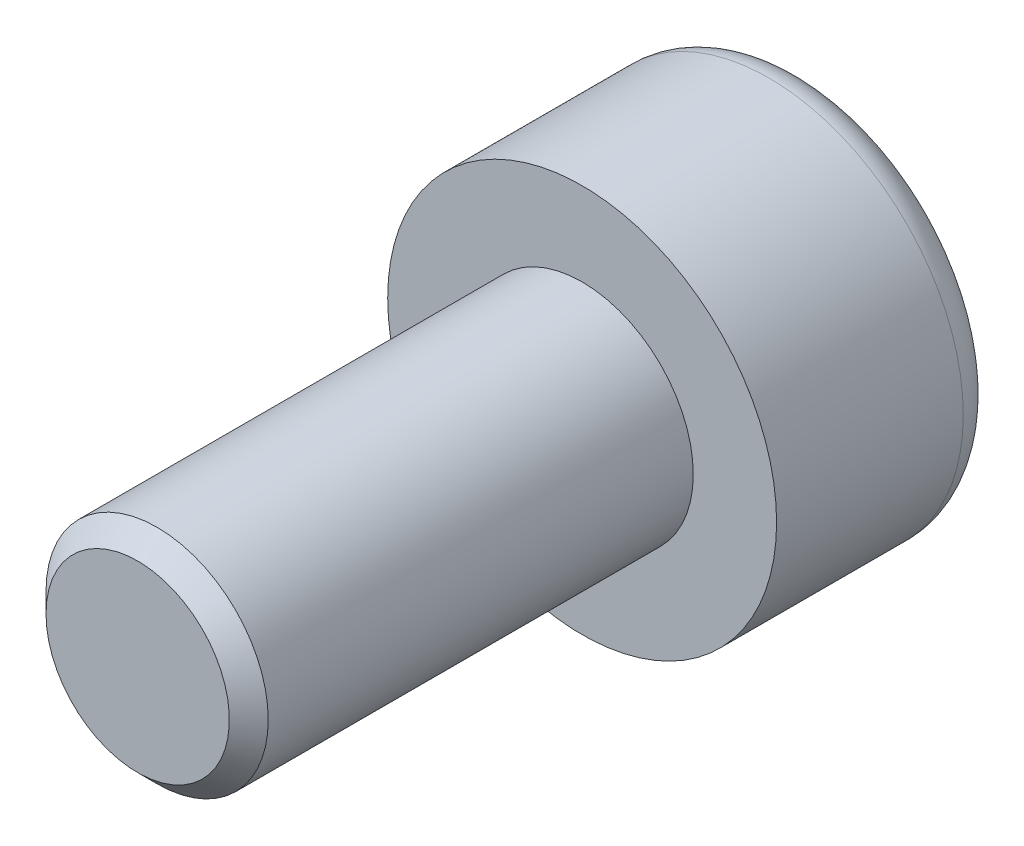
from build123d import *

# Parameters (mm, degrees)
ENLEV_MAT_EXTRU1_DEPTH = 2
ESQUISSE3_W            = 2
ESQUISSE3_H            = 8
CHANFREIN1_SIZE        = 0.35


with BuildPart() as part:
    # Esquisse1 → Base-R_volution (revolve)
    with BuildSketch(Plane(origin=(0, 0, 0), x_dir=(1, 0, 0), z_dir=(0, 1, 0)), mode=Mode.PRIVATE) as base_r_volution_sk:
        with BuildLine():
            Line((0, 0), (3.5, 0))
            Line((3.5, 0), (3.5, 3.36))
            ThreePointArc((3.5, 3.36), (3.31254834, 3.81254834), (2.86, 4))
            Line((2.86, 4), (0, 4))
            Line((0, 4), (0, 0))
        make_face()
    revolve(base_r_volution_sk.sketch.rotate(Axis((0, 0, 0), (0, 0, -1)), 180), axis=Axis((0, 0, 0), (0, 0, -1)))

    # Esquisse2 → enlev-mat-Extru1 (cut)
    with BuildSketch(Plane.XY.offset(-4)):
        Polygon((1.5, -0.866025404), (1.5, 0.866025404), (0, 1.732050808), (-1.5, 0.866025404), (-1.5, -0.866025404), (0, -1.732050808), align=None)
    extrude(amount=ENLEV_MAT_EXTRU1_DEPTH, mode=Mode.SUBTRACT)

    # Esquisse3 → Boss.-R_vol.1 (revolve)
    with BuildSketch(Plane(origin=(0, 0, 0), x_dir=(1, 0, 0), z_dir=(0, 1, 0))):
        with Locations((1, -4)):
            Rectangle(ESQUISSE3_W, ESQUISSE3_H)
    revolve(axis=Axis((0, 0, 0), (0, 0, 1)))

    # Chanfrein1
    chanfrein1_edges = [part.edges().sort_by_distance(p)[0] for p in [
        (-2, 0, 8),
    ]]
    chamfer(chanfrein1_edges, length=CHANFREIN1_SIZE)


solid = part.part
